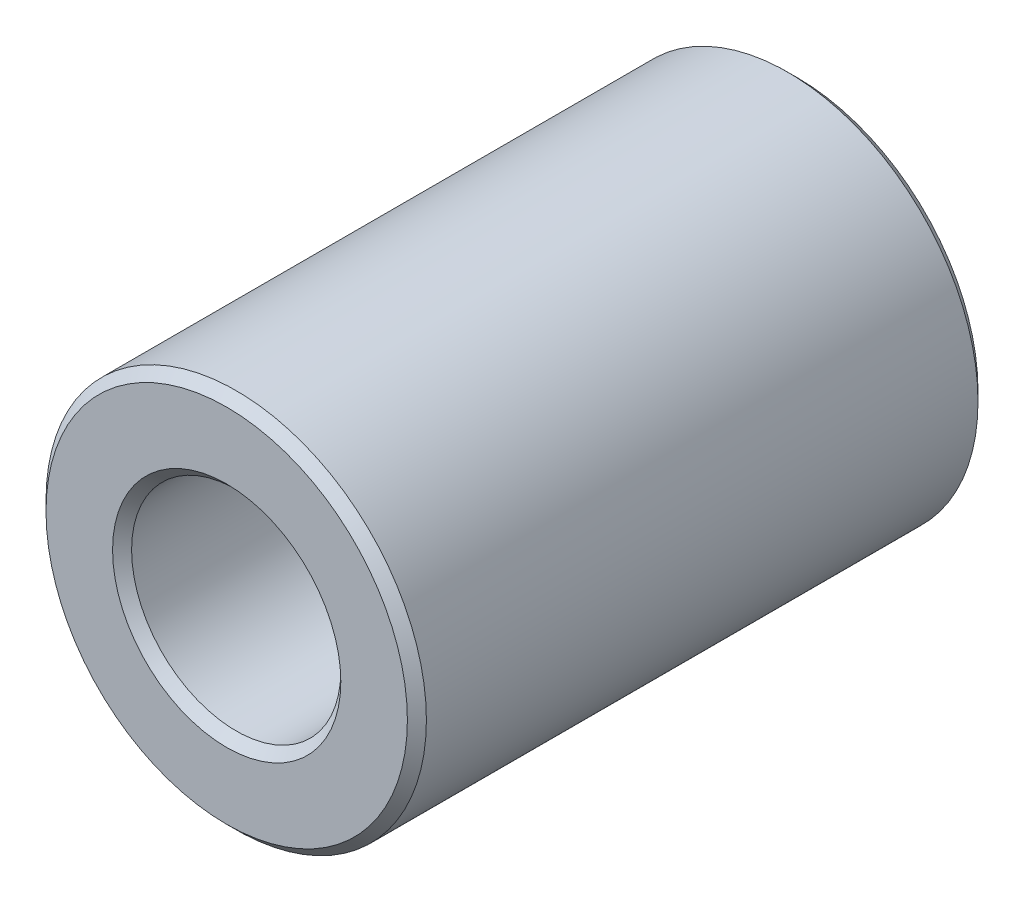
from build123d import *

# Parameters (mm, degrees)
SKETCH1_R           = 2
SKETCH1_R_2         = 1.1
BOSS_EXTRUDE2_DEPTH = 3
CHAMFER3_SIZE       = 0.1


with BuildPart() as part:
    # Sketch1 → Boss-Extrude2 (new, symmetric)
    with BuildSketch(Plane.XY):
        Circle(SKETCH1_R)
        Circle(SKETCH1_R_2, mode=Mode.SUBTRACT)
    extrude(amount=BOSS_EXTRUDE2_DEPTH, both=True)

    # Chamfer3
    chamfer3_edges = [part.edges().sort_by_distance(p)[0] for p in [
        (-2, 0, -3),
        (-2, 0, 3),
        (-1.1, 0, -3),
        (-1.1, 0, 3),
    ]]
    chamfer(chamfer3_edges, length=CHAMFER3_SIZE)


solid = part.part
